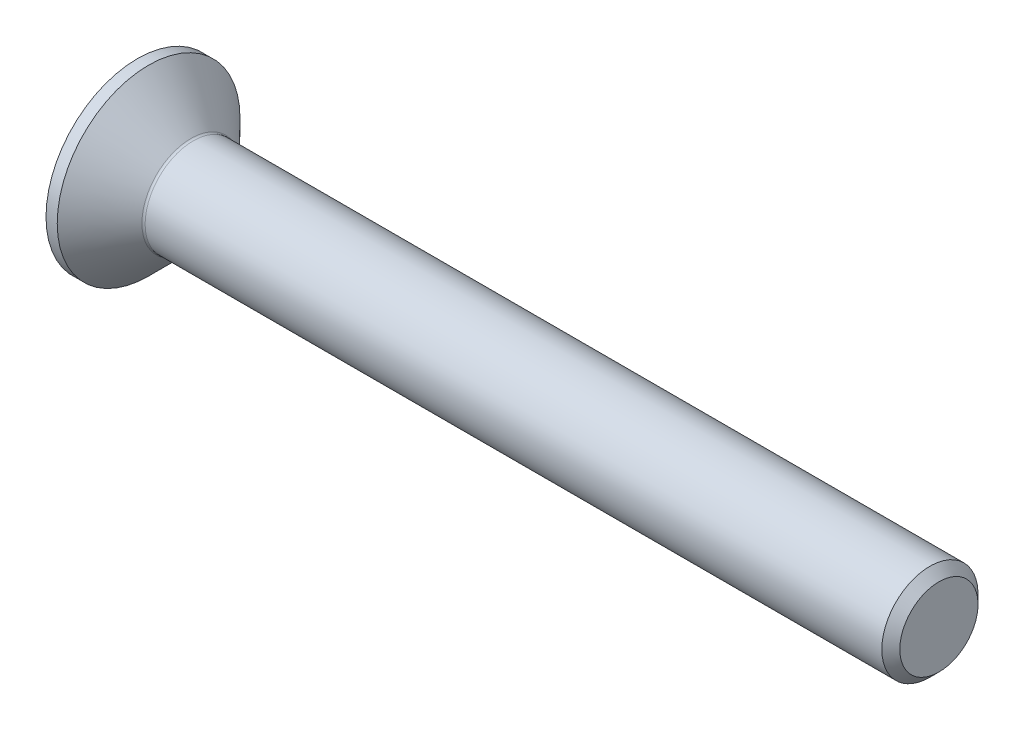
ISO-10303-21;
HEADER;
FILE_DESCRIPTION(('STEP AP214'),'2;1');
FILE_NAME('part.step','',(''),(''),'','','');
FILE_SCHEMA(('AUTOMOTIVE_DESIGN { 1 0 10303 214 1 1 1 1 }'));
ENDSEC;
DATA;
#1=APPLICATION_CONTEXT('core data for automotive mechanical design processes');
#2=APPLICATION_PROTOCOL_DEFINITION('international standard','automotive_design',2000,#1);
#3=PRODUCT_CONTEXT('',#1,'mechanical');
#4=PRODUCT('Part','Part','',(#3));
#5=PRODUCT_RELATED_PRODUCT_CATEGORY('part','',(#4));
#6=PRODUCT_DEFINITION_FORMATION('','',#4);
#7=PRODUCT_DEFINITION_CONTEXT('part definition',#1,'design');
#8=PRODUCT_DEFINITION('design','',#6,#7);
#9=PRODUCT_DEFINITION_SHAPE('','',#8);
#10=(LENGTH_UNIT() NAMED_UNIT(*) SI_UNIT(.MILLI.,.METRE.));
#11=(NAMED_UNIT(*) PLANE_ANGLE_UNIT() SI_UNIT($,.RADIAN.));
#12=(NAMED_UNIT(*) SI_UNIT($,.STERADIAN.) SOLID_ANGLE_UNIT());
#13=UNCERTAINTY_MEASURE_WITH_UNIT(LENGTH_MEASURE(1.E-05),#10,'distance_accuracy_value','');
#14=(GEOMETRIC_REPRESENTATION_CONTEXT(3) GLOBAL_UNCERTAINTY_ASSIGNED_CONTEXT((#13)) GLOBAL_UNIT_ASSIGNED_CONTEXT((#10,
#11,#12)) REPRESENTATION_CONTEXT('',''));
#15=CARTESIAN_POINT('',(0.,0.,0.));
#16=DIRECTION('',(0.,0.,1.));
#17=DIRECTION('',(1.,0.,0.));
#18=AXIS2_PLACEMENT_3D('',#15,#16,#17);
#19=CARTESIAN_POINT('',(1.20000000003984,0.,0.));
#20=DIRECTION('',(-1.,0.,0.));
#21=DIRECTION('',(0.,0.,1.));
#22=AXIS2_PLACEMENT_3D('',#19,#20,#21);
#23=CONICAL_SURFACE('',#22,1.00999999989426,1.04719755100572);
#24=CARTESIAN_POINT('',(1.78312377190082,0.,-2.55795384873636E-10));
#25=VERTEX_POINT('',#24);
#26=VERTEX_LOOP('',#25);
#27=FACE_BOUND('',#26,.T.);
#28=CARTESIAN_POINT('',(1.1999999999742,0.,0.));
#29=DIRECTION('',(-1.,0.,0.));
#30=DIRECTION('',(0.,0.,1.));
#31=AXIS2_PLACEMENT_3D('',#28,#29,#30);
#32=CIRCLE('',#31,1.01000000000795);
#33=CARTESIAN_POINT('',(1.1999999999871,0.874685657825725,-0.505000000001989));
#34=VERTEX_POINT('',#33);
#35=CARTESIAN_POINT('',(1.1999999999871,0.,-1.01000000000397));
#36=VERTEX_POINT('',#35);
#37=EDGE_CURVE('E91',#34,#36,#32,.T.);
#38=ORIENTED_EDGE('',*,*,#37,.T.);
#39=CARTESIAN_POINT('',(1.1999999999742,0.,0.));
#40=DIRECTION('',(-1.,0.,0.));
#41=DIRECTION('',(0.,0.,1.));
#42=AXIS2_PLACEMENT_3D('',#39,#40,#41);
#43=CIRCLE('',#42,1.01000000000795);
#44=CARTESIAN_POINT('',(1.1999999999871,-0.874685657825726,-0.505000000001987));
#45=VERTEX_POINT('',#44);
#46=EDGE_CURVE('E87',#36,#45,#43,.T.);
#47=ORIENTED_EDGE('',*,*,#46,.T.);
#48=CARTESIAN_POINT('',(1.1999999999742,0.,0.));
#49=DIRECTION('',(-1.,0.,0.));
#50=DIRECTION('',(0.,0.,1.));
#51=AXIS2_PLACEMENT_3D('',#48,#49,#50);
#52=CIRCLE('',#51,1.01000000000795);
#53=CARTESIAN_POINT('',(1.1999999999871,-0.874685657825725,0.505000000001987));
#54=VERTEX_POINT('',#53);
#55=EDGE_CURVE('E20',#45,#54,#52,.T.);
#56=ORIENTED_EDGE('',*,*,#55,.T.);
#57=CARTESIAN_POINT('',(1.1999999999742,0.,0.));
#58=DIRECTION('',(-1.,0.,0.));
#59=DIRECTION('',(0.,0.,1.));
#60=AXIS2_PLACEMENT_3D('',#57,#58,#59);
#61=CIRCLE('',#60,1.01000000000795);
#62=CARTESIAN_POINT('',(1.1999999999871,0.,1.01000000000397));
#63=VERTEX_POINT('',#62);
#64=EDGE_CURVE('E146',#54,#63,#61,.T.);
#65=ORIENTED_EDGE('',*,*,#64,.T.);
#66=CARTESIAN_POINT('',(1.1999999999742,0.,0.));
#67=DIRECTION('',(-1.,0.,0.));
#68=DIRECTION('',(0.,0.,1.));
#69=AXIS2_PLACEMENT_3D('',#66,#67,#68);
#70=CIRCLE('',#69,1.01000000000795);
#71=CARTESIAN_POINT('',(1.1999999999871,0.874685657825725,0.50500000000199));
#72=VERTEX_POINT('',#71);
#73=EDGE_CURVE('E148',#63,#72,#70,.T.);
#74=ORIENTED_EDGE('',*,*,#73,.T.);
#75=CARTESIAN_POINT('',(1.1999999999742,0.,0.));
#76=DIRECTION('',(-1.,0.,0.));
#77=DIRECTION('',(0.,0.,1.));
#78=AXIS2_PLACEMENT_3D('',#75,#76,#77);
#79=CIRCLE('',#78,1.01000000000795);
#80=EDGE_CURVE('E150',#72,#34,#79,.T.);
#81=ORIENTED_EDGE('',*,*,#80,.T.);
#82=EDGE_LOOP('',(#38,#47,#56,#65,#74,#81));
#83=FACE_BOUND('',#82,.T.);
#84=ADVANCED_FACE('F17',(#27,#83),#23,.F.);
#85=CARTESIAN_POINT('',(1.2,-0.583123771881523,-1.01));
#86=DIRECTION('',(1.,0.,0.));
#87=DIRECTION('',(0.,0.,-1.));
#88=AXIS2_PLACEMENT_3D('',#85,#86,#87);
#89=PLANE('',#88);
#90=DIRECTION('',(0.,0.5,0.866025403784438));
#91=VECTOR('',#90,1.);
#92=CARTESIAN_POINT('',(1.2,-0.583123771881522,1.01));
#93=LINE('',#92,#91);
#94=CARTESIAN_POINT('',(1.2,-1.16624754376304,0.));
#95=VERTEX_POINT('',#94);
#96=EDGE_CURVE('E103',#54,#95,#93,.F.);
#97=ORIENTED_EDGE('',*,*,#96,.F.);
#98=ORIENTED_EDGE('',*,*,#55,.F.);
#99=DIRECTION('',(0.,-0.499999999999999,0.866025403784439));
#100=VECTOR('',#99,1.);
#101=CARTESIAN_POINT('',(1.2,-1.16624754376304,0.));
#102=LINE('',#101,#100);
#103=EDGE_CURVE('E101',#95,#45,#102,.F.);
#104=ORIENTED_EDGE('',*,*,#103,.F.);
#105=EDGE_LOOP('',(#97,#98,#104));
#106=FACE_BOUND('',#105,.T.);
#107=ADVANCED_FACE('F99',(#106),#89,.F.);
#108=CARTESIAN_POINT('',(1.2,-0.583123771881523,-1.01));
#109=DIRECTION('',(1.,0.,0.));
#110=DIRECTION('',(0.,0.,-1.));
#111=AXIS2_PLACEMENT_3D('',#108,#109,#110);
#112=PLANE('',#111);
#113=DIRECTION('',(0.,-0.499999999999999,0.866025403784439));
#114=VECTOR('',#113,1.);
#115=CARTESIAN_POINT('',(1.2,-1.16624754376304,0.));
#116=LINE('',#115,#114);
#117=CARTESIAN_POINT('',(1.2,-0.583123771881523,-1.01));
#118=VERTEX_POINT('',#117);
#119=EDGE_CURVE('E105',#45,#118,#116,.F.);
#120=ORIENTED_EDGE('',*,*,#119,.F.);
#121=ORIENTED_EDGE('',*,*,#46,.F.);
#122=DIRECTION('',(0.,-1.,0.));
#123=VECTOR('',#122,1.);
#124=CARTESIAN_POINT('',(1.2,-0.583123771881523,-1.01));
#125=LINE('',#124,#123);
#126=EDGE_CURVE('E108',#118,#36,#125,.F.);
#127=ORIENTED_EDGE('',*,*,#126,.F.);
#128=EDGE_LOOP('',(#120,#121,#127));
#129=FACE_BOUND('',#128,.T.);
#130=ADVANCED_FACE('F106',(#129),#112,.F.);
#131=CARTESIAN_POINT('',(1.2,-0.583123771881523,-1.01));
#132=DIRECTION('',(1.,0.,0.));
#133=DIRECTION('',(0.,0.,-1.));
#134=AXIS2_PLACEMENT_3D('',#131,#132,#133);
#135=PLANE('',#134);
#136=DIRECTION('',(0.,-1.,0.));
#137=VECTOR('',#136,1.);
#138=CARTESIAN_POINT('',(1.2,-0.583123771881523,-1.01));
#139=LINE('',#138,#137);
#140=CARTESIAN_POINT('',(1.2,0.583123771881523,-1.01));
#141=VERTEX_POINT('',#140);
#142=EDGE_CURVE('E164',#36,#141,#139,.F.);
#143=ORIENTED_EDGE('',*,*,#142,.F.);
#144=ORIENTED_EDGE('',*,*,#37,.F.);
#145=DIRECTION('',(0.,-0.500000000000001,-0.866025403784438));
#146=VECTOR('',#145,1.);
#147=CARTESIAN_POINT('',(1.2,0.583123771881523,-1.01));
#148=LINE('',#147,#146);
#149=EDGE_CURVE('E162',#141,#34,#148,.F.);
#150=ORIENTED_EDGE('',*,*,#149,.F.);
#151=EDGE_LOOP('',(#143,#144,#150));
#152=FACE_BOUND('',#151,.T.);
#153=ADVANCED_FACE('F160',(#152),#135,.F.);
#154=CARTESIAN_POINT('',(1.2,-0.583123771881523,-1.01));
#155=DIRECTION('',(1.,0.,0.));
#156=DIRECTION('',(0.,0.,-1.));
#157=AXIS2_PLACEMENT_3D('',#154,#155,#156);
#158=PLANE('',#157);
#159=DIRECTION('',(0.,-0.500000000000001,-0.866025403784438));
#160=VECTOR('',#159,1.);
#161=CARTESIAN_POINT('',(1.2,0.583123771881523,-1.01));
#162=LINE('',#161,#160);
#163=CARTESIAN_POINT('',(1.2,1.16624754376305,0.));
#164=VERTEX_POINT('',#163);
#165=EDGE_CURVE('E165',#34,#164,#162,.F.);
#166=ORIENTED_EDGE('',*,*,#165,.F.);
#167=ORIENTED_EDGE('',*,*,#80,.F.);
#168=DIRECTION('',(0.,0.500000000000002,-0.866025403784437));
#169=VECTOR('',#168,1.);
#170=CARTESIAN_POINT('',(1.2,1.16624754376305,0.));
#171=LINE('',#170,#169);
#172=EDGE_CURVE('E168',#164,#72,#171,.F.);
#173=ORIENTED_EDGE('',*,*,#172,.F.);
#174=EDGE_LOOP('',(#166,#167,#173));
#175=FACE_BOUND('',#174,.T.);
#176=ADVANCED_FACE('F166',(#175),#158,.F.);
#177=CARTESIAN_POINT('',(1.2,-0.583123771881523,-1.01));
#178=DIRECTION('',(1.,0.,0.));
#179=DIRECTION('',(0.,0.,-1.));
#180=AXIS2_PLACEMENT_3D('',#177,#178,#179);
#181=PLANE('',#180);
#182=DIRECTION('',(0.,0.500000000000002,-0.866025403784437));
#183=VECTOR('',#182,1.);
#184=CARTESIAN_POINT('',(1.2,1.16624754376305,0.));
#185=LINE('',#184,#183);
#186=CARTESIAN_POINT('',(1.2,0.583123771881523,1.01));
#187=VERTEX_POINT('',#186);
#188=EDGE_CURVE('E224',#72,#187,#185,.F.);
#189=ORIENTED_EDGE('',*,*,#188,.F.);
#190=ORIENTED_EDGE('',*,*,#73,.F.);
#191=DIRECTION('',(0.,1.,0.));
#192=VECTOR('',#191,1.);
#193=CARTESIAN_POINT('',(1.2,0.583123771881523,1.01));
#194=LINE('',#193,#192);
#195=EDGE_CURVE('E236',#187,#63,#194,.F.);
#196=ORIENTED_EDGE('',*,*,#195,.F.);
#197=EDGE_LOOP('',(#189,#190,#196));
#198=FACE_BOUND('',#197,.T.);
#199=ADVANCED_FACE('F304',(#198),#181,.F.);
#200=CARTESIAN_POINT('',(1.2,-0.583123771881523,-1.01));
#201=DIRECTION('',(1.,0.,0.));
#202=DIRECTION('',(0.,0.,-1.));
#203=AXIS2_PLACEMENT_3D('',#200,#201,#202);
#204=PLANE('',#203);
#205=DIRECTION('',(0.,1.,0.));
#206=VECTOR('',#205,1.);
#207=CARTESIAN_POINT('',(1.2,0.583123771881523,1.01));
#208=LINE('',#207,#206);
#209=CARTESIAN_POINT('',(1.2,-0.583123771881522,1.01));
#210=VERTEX_POINT('',#209);
#211=EDGE_CURVE('E244',#63,#210,#208,.F.);
#212=ORIENTED_EDGE('',*,*,#211,.F.);
#213=ORIENTED_EDGE('',*,*,#64,.F.);
#214=DIRECTION('',(0.,0.5,0.866025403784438));
#215=VECTOR('',#214,1.);
#216=CARTESIAN_POINT('',(1.2,-0.583123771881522,1.01));
#217=LINE('',#216,#215);
#218=EDGE_CURVE('E127',#210,#54,#217,.F.);
#219=ORIENTED_EDGE('',*,*,#218,.F.);
#220=EDGE_LOOP('',(#212,#213,#219));
#221=FACE_BOUND('',#220,.T.);
#222=ADVANCED_FACE('F300',(#221),#204,.F.);
#223=CARTESIAN_POINT('',(1.2,-0.583123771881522,1.01));
#224=DIRECTION('',(0.,0.866025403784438,-0.5));
#225=DIRECTION('',(0.,0.5,0.866025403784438));
#226=AXIS2_PLACEMENT_3D('',#223,#224,#225);
#227=PLANE('',#226);
#228=ORIENTED_EDGE('',*,*,#96,.T.);
#229=DIRECTION('',(1.,0.,0.));
#230=VECTOR('',#229,1.);
#231=CARTESIAN_POINT('',(1.2,-1.16624754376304,0.));
#232=LINE('',#231,#230);
#233=CARTESIAN_POINT('',(0.,-1.16624754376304,0.));
#234=VERTEX_POINT('',#233);
#235=EDGE_CURVE('E115',#234,#95,#232,.T.);
#236=ORIENTED_EDGE('',*,*,#235,.F.);
#237=DIRECTION('',(0.,-0.5,-0.866025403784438));
#238=VECTOR('',#237,1.);
#239=CARTESIAN_POINT('',(0.,-0.583123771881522,1.01));
#240=LINE('',#239,#238);
#241=CARTESIAN_POINT('',(0.,-0.583123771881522,1.01));
#242=VERTEX_POINT('',#241);
#243=EDGE_CURVE('E130',#242,#234,#240,.T.);
#244=ORIENTED_EDGE('',*,*,#243,.F.);
#245=DIRECTION('',(-1.,0.,0.));
#246=VECTOR('',#245,1.);
#247=CARTESIAN_POINT('',(1.2,-0.583123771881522,1.01));
#248=LINE('',#247,#246);
#249=EDGE_CURVE('E134',#210,#242,#248,.T.);
#250=ORIENTED_EDGE('',*,*,#249,.F.);
#251=ORIENTED_EDGE('',*,*,#218,.T.);
#252=EDGE_LOOP('',(#228,#236,#244,#250,#251));
#253=FACE_BOUND('',#252,.T.);
#254=ADVANCED_FACE('F297',(#253),#227,.T.);
#255=CARTESIAN_POINT('',(1.2,-1.16624754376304,0.));
#256=DIRECTION('',(0.,0.866025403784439,0.499999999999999));
#257=DIRECTION('',(0.,-0.499999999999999,0.866025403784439));
#258=AXIS2_PLACEMENT_3D('',#255,#256,#257);
#259=PLANE('',#258);
#260=ORIENTED_EDGE('',*,*,#119,.T.);
#261=DIRECTION('',(1.,0.,0.));
#262=VECTOR('',#261,1.);
#263=CARTESIAN_POINT('',(1.2,-0.583123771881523,-1.01));
#264=LINE('',#263,#262);
#265=CARTESIAN_POINT('',(0.,-0.583123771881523,-1.01));
#266=VERTEX_POINT('',#265);
#267=EDGE_CURVE('E111',#266,#118,#264,.T.);
#268=ORIENTED_EDGE('',*,*,#267,.F.);
#269=DIRECTION('',(0.,0.5,-0.866025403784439));
#270=VECTOR('',#269,1.);
#271=CARTESIAN_POINT('',(0.,-1.16624754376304,0.));
#272=LINE('',#271,#270);
#273=EDGE_CURVE('E133',#234,#266,#272,.T.);
#274=ORIENTED_EDGE('',*,*,#273,.F.);
#275=ORIENTED_EDGE('',*,*,#235,.T.);
#276=ORIENTED_EDGE('',*,*,#103,.T.);
#277=EDGE_LOOP('',(#260,#268,#274,#275,#276));
#278=FACE_BOUND('',#277,.T.);
#279=ADVANCED_FACE('F113',(#278),#259,.T.);
#280=CARTESIAN_POINT('',(1.2,-0.583123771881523,-1.01));
#281=DIRECTION('',(0.,0.,1.));
#282=DIRECTION('',(0.,-1.,0.));
#283=AXIS2_PLACEMENT_3D('',#280,#281,#282);
#284=PLANE('',#283);
#285=ORIENTED_EDGE('',*,*,#142,.T.);
#286=DIRECTION('',(1.,0.,0.));
#287=VECTOR('',#286,1.);
#288=CARTESIAN_POINT('',(1.2,0.583123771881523,-1.01));
#289=LINE('',#288,#287);
#290=CARTESIAN_POINT('',(0.,0.583123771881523,-1.01));
#291=VERTEX_POINT('',#290);
#292=EDGE_CURVE('E175',#291,#141,#289,.T.);
#293=ORIENTED_EDGE('',*,*,#292,.F.);
#294=DIRECTION('',(0.,1.,0.));
#295=VECTOR('',#294,1.);
#296=CARTESIAN_POINT('',(0.,0.,-1.01));
#297=LINE('',#296,#295);
#298=EDGE_CURVE('E189',#266,#291,#297,.T.);
#299=ORIENTED_EDGE('',*,*,#298,.F.);
#300=ORIENTED_EDGE('',*,*,#267,.T.);
#301=ORIENTED_EDGE('',*,*,#126,.T.);
#302=EDGE_LOOP('',(#285,#293,#299,#300,#301));
#303=FACE_BOUND('',#302,.T.);
#304=ADVANCED_FACE('F212',(#303),#284,.T.);
#305=CARTESIAN_POINT('',(1.2,0.583123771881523,-1.01));
#306=DIRECTION('',(0.,-0.866025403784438,0.500000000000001));
#307=DIRECTION('',(0.,-0.500000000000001,-0.866025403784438));
#308=AXIS2_PLACEMENT_3D('',#305,#306,#307);
#309=PLANE('',#308);
#310=ORIENTED_EDGE('',*,*,#165,.T.);
#311=DIRECTION('',(1.,0.,0.));
#312=VECTOR('',#311,1.);
#313=CARTESIAN_POINT('',(1.2,1.16624754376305,0.));
#314=LINE('',#313,#312);
#315=CARTESIAN_POINT('',(0.,1.16624754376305,0.));
#316=VERTEX_POINT('',#315);
#317=EDGE_CURVE('E171',#316,#164,#314,.T.);
#318=ORIENTED_EDGE('',*,*,#317,.F.);
#319=DIRECTION('',(0.,0.500000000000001,0.866025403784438));
#320=VECTOR('',#319,1.);
#321=CARTESIAN_POINT('',(0.,0.583123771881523,-1.01));
#322=LINE('',#321,#320);
#323=EDGE_CURVE('E192',#291,#316,#322,.T.);
#324=ORIENTED_EDGE('',*,*,#323,.F.);
#325=ORIENTED_EDGE('',*,*,#292,.T.);
#326=ORIENTED_EDGE('',*,*,#149,.T.);
#327=EDGE_LOOP('',(#310,#318,#324,#325,#326));
#328=FACE_BOUND('',#327,.T.);
#329=ADVANCED_FACE('F173',(#328),#309,.T.);
#330=CARTESIAN_POINT('',(1.2,1.16624754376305,0.));
#331=DIRECTION('',(0.,-0.866025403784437,-0.500000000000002));
#332=DIRECTION('',(0.,0.500000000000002,-0.866025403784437));
#333=AXIS2_PLACEMENT_3D('',#330,#331,#332);
#334=PLANE('',#333);
#335=ORIENTED_EDGE('',*,*,#188,.T.);
#336=DIRECTION('',(-1.,0.,0.));
#337=VECTOR('',#336,1.);
#338=CARTESIAN_POINT('',(1.2,0.583123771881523,1.01));
#339=LINE('',#338,#337);
#340=CARTESIAN_POINT('',(0.,0.583123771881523,1.01));
#341=VERTEX_POINT('',#340);
#342=EDGE_CURVE('E35',#341,#187,#339,.F.);
#343=ORIENTED_EDGE('',*,*,#342,.F.);
#344=DIRECTION('',(0.,-0.500000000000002,0.866025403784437));
#345=VECTOR('',#344,1.);
#346=CARTESIAN_POINT('',(0.,1.16624754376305,0.));
#347=LINE('',#346,#345);
#348=EDGE_CURVE('E213',#316,#341,#347,.T.);
#349=ORIENTED_EDGE('',*,*,#348,.F.);
#350=ORIENTED_EDGE('',*,*,#317,.T.);
#351=ORIENTED_EDGE('',*,*,#172,.T.);
#352=EDGE_LOOP('',(#335,#343,#349,#350,#351));
#353=FACE_BOUND('',#352,.T.);
#354=ADVANCED_FACE('F287',(#353),#334,.T.);
#355=CARTESIAN_POINT('',(1.2,0.583123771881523,1.01));
#356=DIRECTION('',(0.,0.,-1.));
#357=DIRECTION('',(-1.,0.,0.));
#358=AXIS2_PLACEMENT_3D('',#355,#356,#357);
#359=PLANE('',#358);
#360=ORIENTED_EDGE('',*,*,#211,.T.);
#361=ORIENTED_EDGE('',*,*,#249,.T.);
#362=DIRECTION('',(0.,1.,0.));
#363=VECTOR('',#362,1.);
#364=CARTESIAN_POINT('',(0.,0.,1.01));
#365=LINE('',#364,#363);
#366=EDGE_CURVE('E145',#341,#242,#365,.F.);
#367=ORIENTED_EDGE('',*,*,#366,.F.);
#368=ORIENTED_EDGE('',*,*,#342,.T.);
#369=ORIENTED_EDGE('',*,*,#195,.T.);
#370=EDGE_LOOP('',(#360,#361,#367,#368,#369));
#371=FACE_BOUND('',#370,.T.);
#372=ADVANCED_FACE('F284',(#371),#359,.T.);
#373=CARTESIAN_POINT('',(0.,0.,0.));
#374=DIRECTION('',(-1.,0.,0.));
#375=DIRECTION('',(0.,0.,1.));
#376=AXIS2_PLACEMENT_3D('',#373,#374,#375);
#377=PLANE('',#376);
#378=ORIENTED_EDGE('',*,*,#348,.T.);
#379=ORIENTED_EDGE('',*,*,#366,.T.);
#380=ORIENTED_EDGE('',*,*,#243,.T.);
#381=ORIENTED_EDGE('',*,*,#273,.T.);
#382=ORIENTED_EDGE('',*,*,#298,.T.);
#383=ORIENTED_EDGE('',*,*,#323,.T.);
#384=EDGE_LOOP('',(#378,#379,#380,#381,#382,#383));
#385=FACE_BOUND('',#384,.T.);
#386=CARTESIAN_POINT('',(0.,0.,0.));
#387=DIRECTION('',(-1.,0.,0.));
#388=DIRECTION('',(0.,0.,1.));
#389=AXIS2_PLACEMENT_3D('',#386,#387,#388);
#390=CIRCLE('',#389,2.85);
#391=CARTESIAN_POINT('',(0.,0.,2.85));
#392=VERTEX_POINT('',#391);
#393=EDGE_CURVE('E142',#392,#392,#390,.F.);
#394=ORIENTED_EDGE('',*,*,#393,.F.);
#395=EDGE_LOOP('',(#394));
#396=FACE_BOUND('',#395,.T.);
#397=ADVANCED_FACE('F205',(#385,#396),#377,.T.);
#398=CARTESIAN_POINT('',(0.,0.,0.));
#399=DIRECTION('',(-1.,0.,0.));
#400=DIRECTION('',(0.,0.,1.));
#401=AXIS2_PLACEMENT_3D('',#398,#399,#400);
#402=CYLINDRICAL_SURFACE('',#401,2.85);
#403=ORIENTED_EDGE('',*,*,#393,.T.);
#404=EDGE_LOOP('',(#403));
#405=FACE_BOUND('',#404,.T.);
#406=CARTESIAN_POINT('',(0.349999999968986,0.,0.));
#407=DIRECTION('',(-1.,0.,0.));
#408=DIRECTION('',(0.,0.,1.));
#409=AXIS2_PLACEMENT_3D('',#406,#407,#408);
#410=CIRCLE('',#409,2.84999999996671);
#411=CARTESIAN_POINT('',(0.349999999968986,0.,2.84999999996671));
#412=VERTEX_POINT('',#411);
#413=EDGE_CURVE('E141',#412,#412,#410,.F.);
#414=ORIENTED_EDGE('',*,*,#413,.F.);
#415=EDGE_LOOP('',(#414));
#416=FACE_BOUND('',#415,.T.);
#417=ADVANCED_FACE('F277',(#405,#416),#402,.T.);
#418=CARTESIAN_POINT('',(25.,1.2195,0.));
#419=DIRECTION('',(1.,0.,0.));
#420=DIRECTION('',(0.,0.,-1.));
#421=AXIS2_PLACEMENT_3D('',#418,#419,#420);
#422=PLANE('',#421);
#423=CARTESIAN_POINT('',(25.0000000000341,0.,0.));
#424=DIRECTION('',(-1.,0.,0.));
#425=DIRECTION('',(0.,-1.,0.));
#426=AXIS2_PLACEMENT_3D('',#423,#424,#425);
#427=CIRCLE('',#426,1.2194999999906);
#428=CARTESIAN_POINT('',(25.0000000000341,-1.2194999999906,0.));
#429=VERTEX_POINT('',#428);
#430=EDGE_CURVE('E137',#429,#429,#427,.T.);
#431=ORIENTED_EDGE('',*,*,#430,.F.);
#432=EDGE_LOOP('',(#431));
#433=FACE_BOUND('',#432,.T.);
#434=ADVANCED_FACE('F273',(#433),#422,.T.);
#435=CARTESIAN_POINT('',(0.349999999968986,0.,0.));
#436=DIRECTION('',(-1.,0.,0.));
#437=DIRECTION('',(0.,0.,1.));
#438=AXIS2_PLACEMENT_3D('',#435,#436,#437);
#439=CONICAL_SURFACE('',#438,2.84999999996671,0.785398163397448);
#440=ORIENTED_EDGE('',*,*,#413,.T.);
#441=EDGE_LOOP('',(#440));
#442=FACE_BOUND('',#441,.T.);
#443=CARTESIAN_POINT('',(1.67071067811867,0.,0.));
#444=DIRECTION('',(-1.,0.,0.));
#445=DIRECTION('',(0.,0.,1.));
#446=AXIS2_PLACEMENT_3D('',#443,#444,#445);
#447=CIRCLE('',#446,1.52928932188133);
#448=CARTESIAN_POINT('',(1.67071067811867,0.,1.52928932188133));
#449=VERTEX_POINT('',#448);
#450=EDGE_CURVE('E140',#449,#449,#447,.T.);
#451=ORIENTED_EDGE('',*,*,#450,.T.);
#452=EDGE_LOOP('',(#451));
#453=FACE_BOUND('',#452,.T.);
#454=ADVANCED_FACE('F269',(#442,#453),#439,.T.);
#455=CARTESIAN_POINT('',(24.7195000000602,0.,0.));
#456=DIRECTION('',(-1.,0.,0.));
#457=DIRECTION('',(0.,-1.,0.));
#458=AXIS2_PLACEMENT_3D('',#455,#456,#457);
#459=CONICAL_SURFACE('',#458,1.49999999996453,0.785398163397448);
#460=CARTESIAN_POINT('',(24.7195,0.,0.));
#461=DIRECTION('',(-1.,0.,0.));
#462=DIRECTION('',(0.,0.,1.));
#463=AXIS2_PLACEMENT_3D('',#460,#461,#462);
#464=CIRCLE('',#463,1.49999999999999);
#465=CARTESIAN_POINT('',(24.7195,0.,1.49999999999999));
#466=VERTEX_POINT('',#465);
#467=EDGE_CURVE('E26',#466,#466,#464,.T.);
#468=ORIENTED_EDGE('',*,*,#467,.F.);
#469=EDGE_LOOP('',(#468));
#470=FACE_BOUND('',#469,.T.);
#471=ORIENTED_EDGE('',*,*,#430,.T.);
#472=EDGE_LOOP('',(#471));
#473=FACE_BOUND('',#472,.T.);
#474=ADVANCED_FACE('F265',(#470,#473),#459,.T.);
#475=CARTESIAN_POINT('',(1.74142135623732,0.,0.));
#476=DIRECTION('',(-1.,0.,0.));
#477=DIRECTION('',(0.,0.,1.));
#478=AXIS2_PLACEMENT_3D('',#475,#476,#477);
#479=TOROIDAL_SURFACE('',#478,1.59999999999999,0.1);
#480=ORIENTED_EDGE('',*,*,#450,.F.);
#481=EDGE_LOOP('',(#480));
#482=FACE_BOUND('',#481,.T.);
#483=CARTESIAN_POINT('',(1.74142135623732,0.,0.));
#484=DIRECTION('',(-1.,0.,0.));
#485=DIRECTION('',(0.,0.,1.));
#486=AXIS2_PLACEMENT_3D('',#483,#484,#485);
#487=CIRCLE('',#486,1.49999999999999);
#488=CARTESIAN_POINT('',(1.74142135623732,0.,1.49999999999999));
#489=VERTEX_POINT('',#488);
#490=EDGE_CURVE('E11',#489,#489,#487,.F.);
#491=ORIENTED_EDGE('',*,*,#490,.F.);
#492=EDGE_LOOP('',(#491));
#493=FACE_BOUND('',#492,.T.);
#494=ADVANCED_FACE('F260',(#482,#493),#479,.F.);
#495=CARTESIAN_POINT('',(0.,0.,0.));
#496=DIRECTION('',(-1.,0.,0.));
#497=DIRECTION('',(0.,0.,1.));
#498=AXIS2_PLACEMENT_3D('',#495,#496,#497);
#499=CYLINDRICAL_SURFACE('',#498,1.49999999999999);
#500=ORIENTED_EDGE('',*,*,#490,.T.);
#501=EDGE_LOOP('',(#500));
#502=FACE_BOUND('',#501,.T.);
#503=ORIENTED_EDGE('',*,*,#467,.T.);
#504=EDGE_LOOP('',(#503));
#505=FACE_BOUND('',#504,.T.);
#506=ADVANCED_FACE('F264',(#502,#505),#499,.T.);
#507=CLOSED_SHELL('',(#84,#107,#130,#153,#176,#199,#222,#254,#279,#304,#329,#354,#372,#397,#417,
#434,#454,#474,#494,#506));
#508=MANIFOLD_SOLID_BREP('B1',#507);
#509=ADVANCED_BREP_SHAPE_REPRESENTATION('',(#18,#508),#14);
#510=SHAPE_DEFINITION_REPRESENTATION(#9,#509);
ENDSEC;
END-ISO-10303-21;
